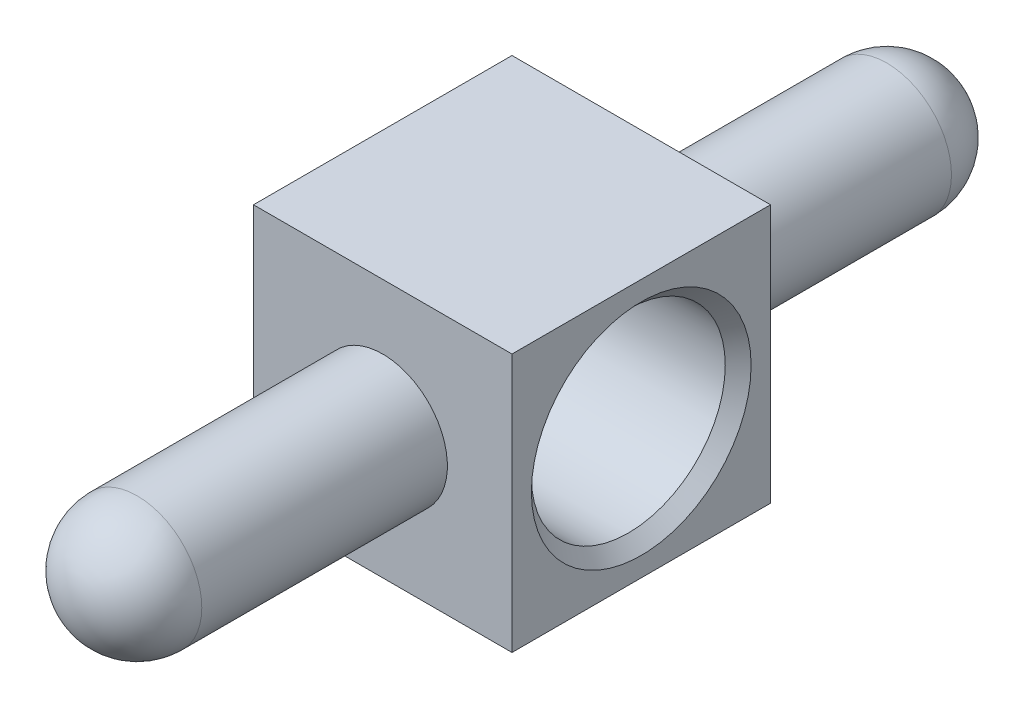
ISO-10303-21;
HEADER;
FILE_DESCRIPTION(('STEP AP214'),'2;1');
FILE_NAME('part.step','',(''),(''),'','','');
FILE_SCHEMA(('AUTOMOTIVE_DESIGN { 1 0 10303 214 1 1 1 1 }'));
ENDSEC;
DATA;
#1=APPLICATION_CONTEXT('core data for automotive mechanical design processes');
#2=APPLICATION_PROTOCOL_DEFINITION('international standard','automotive_design',2000,#1);
#3=PRODUCT_CONTEXT('',#1,'mechanical');
#4=PRODUCT('Part','Part','',(#3));
#5=PRODUCT_RELATED_PRODUCT_CATEGORY('part','',(#4));
#6=PRODUCT_DEFINITION_FORMATION('','',#4);
#7=PRODUCT_DEFINITION_CONTEXT('part definition',#1,'design');
#8=PRODUCT_DEFINITION('design','',#6,#7);
#9=PRODUCT_DEFINITION_SHAPE('','',#8);
#10=(LENGTH_UNIT() NAMED_UNIT(*) SI_UNIT(.MILLI.,.METRE.));
#11=(NAMED_UNIT(*) PLANE_ANGLE_UNIT() SI_UNIT($,.RADIAN.));
#12=(NAMED_UNIT(*) SI_UNIT($,.STERADIAN.) SOLID_ANGLE_UNIT());
#13=UNCERTAINTY_MEASURE_WITH_UNIT(LENGTH_MEASURE(1.E-05),#10,'distance_accuracy_value','');
#14=(GEOMETRIC_REPRESENTATION_CONTEXT(3) GLOBAL_UNCERTAINTY_ASSIGNED_CONTEXT((#13)) GLOBAL_UNIT_ASSIGNED_CONTEXT((#10,
#11,#12)) REPRESENTATION_CONTEXT('',''));
#15=CARTESIAN_POINT('',(0.,0.,0.));
#16=DIRECTION('',(0.,0.,1.));
#17=DIRECTION('',(1.,0.,0.));
#18=AXIS2_PLACEMENT_3D('',#15,#16,#17);
#19=CARTESIAN_POINT('',(0.,25.4,0.));
#20=DIRECTION('',(1.,0.,0.));
#21=DIRECTION('',(0.,0.,-1.));
#22=AXIS2_PLACEMENT_3D('',#19,#20,#21);
#23=PLANE('',#22);
#24=CARTESIAN_POINT('',(0.,12.7,12.7));
#25=DIRECTION('',(1.,0.,0.));
#26=DIRECTION('',(0.,0.,-1.));
#27=AXIS2_PLACEMENT_3D('',#24,#25,#26);
#28=CIRCLE('',#27,10.795);
#29=CARTESIAN_POINT('',(0.,12.7,1.905));
#30=VERTEX_POINT('',#29);
#31=EDGE_CURVE('E118',#30,#30,#28,.T.);
#32=ORIENTED_EDGE('',*,*,#31,.T.);
#33=EDGE_LOOP('',(#32));
#34=FACE_BOUND('',#33,.T.);
#35=DIRECTION('',(0.,0.,1.));
#36=VECTOR('',#35,1.);
#37=CARTESIAN_POINT('',(0.,0.,0.));
#38=LINE('',#37,#36);
#39=CARTESIAN_POINT('',(0.,0.,0.));
#40=VERTEX_POINT('',#39);
#41=CARTESIAN_POINT('',(0.,0.,25.4));
#42=VERTEX_POINT('',#41);
#43=EDGE_CURVE('E103',#40,#42,#38,.T.);
#44=ORIENTED_EDGE('',*,*,#43,.T.);
#45=DIRECTION('',(0.,-1.,0.));
#46=VECTOR('',#45,1.);
#47=CARTESIAN_POINT('',(0.,25.4,25.4));
#48=LINE('',#47,#46);
#49=CARTESIAN_POINT('',(0.,25.4,25.4));
#50=VERTEX_POINT('',#49);
#51=EDGE_CURVE('E94',#50,#42,#48,.T.);
#52=ORIENTED_EDGE('',*,*,#51,.F.);
#53=DIRECTION('',(0.,0.,1.));
#54=VECTOR('',#53,1.);
#55=CARTESIAN_POINT('',(0.,25.4,0.));
#56=LINE('',#55,#54);
#57=CARTESIAN_POINT('',(0.,25.4,0.));
#58=VERTEX_POINT('',#57);
#59=EDGE_CURVE('E88',#58,#50,#56,.T.);
#60=ORIENTED_EDGE('',*,*,#59,.F.);
#61=DIRECTION('',(0.,-1.,0.));
#62=VECTOR('',#61,1.);
#63=CARTESIAN_POINT('',(0.,25.4,0.));
#64=LINE('',#63,#62);
#65=EDGE_CURVE('E99',#58,#40,#64,.T.);
#66=ORIENTED_EDGE('',*,*,#65,.T.);
#67=EDGE_LOOP('',(#44,#52,#60,#66));
#68=FACE_BOUND('',#67,.T.);
#69=ADVANCED_FACE('F33',(#34,#68),#23,.F.);
#70=CARTESIAN_POINT('',(0.,25.4,25.4));
#71=DIRECTION('',(0.,0.,-1.));
#72=DIRECTION('',(-1.,0.,0.));
#73=AXIS2_PLACEMENT_3D('',#70,#71,#72);
#74=PLANE('',#73);
#75=CARTESIAN_POINT('',(12.7,12.7,25.4));
#76=DIRECTION('',(0.,0.,1.));
#77=DIRECTION('',(1.,0.,0.));
#78=AXIS2_PLACEMENT_3D('',#75,#76,#77);
#79=CIRCLE('',#78,6.35);
#80=CARTESIAN_POINT('',(6.35,12.7,25.4));
#81=VERTEX_POINT('',#80);
#82=EDGE_CURVE('E11',#81,#81,#79,.T.);
#83=ORIENTED_EDGE('',*,*,#82,.F.);
#84=EDGE_LOOP('',(#83));
#85=FACE_BOUND('',#84,.T.);
#86=DIRECTION('',(1.,0.,0.));
#87=VECTOR('',#86,1.);
#88=CARTESIAN_POINT('',(0.,0.,25.4));
#89=LINE('',#88,#87);
#90=CARTESIAN_POINT('',(25.4,0.,25.4));
#91=VERTEX_POINT('',#90);
#92=EDGE_CURVE('E93',#42,#91,#89,.T.);
#93=ORIENTED_EDGE('',*,*,#92,.T.);
#94=DIRECTION('',(0.,-1.,0.));
#95=VECTOR('',#94,1.);
#96=CARTESIAN_POINT('',(25.4,25.4,25.4));
#97=LINE('',#96,#95);
#98=CARTESIAN_POINT('',(25.4,25.4,25.4));
#99=VERTEX_POINT('',#98);
#100=EDGE_CURVE('E91',#99,#91,#97,.T.);
#101=ORIENTED_EDGE('',*,*,#100,.F.);
#102=DIRECTION('',(1.,0.,0.));
#103=VECTOR('',#102,1.);
#104=CARTESIAN_POINT('',(0.,25.4,25.4));
#105=LINE('',#104,#103);
#106=EDGE_CURVE('E83',#50,#99,#105,.T.);
#107=ORIENTED_EDGE('',*,*,#106,.F.);
#108=ORIENTED_EDGE('',*,*,#51,.T.);
#109=EDGE_LOOP('',(#93,#101,#107,#108));
#110=FACE_BOUND('',#109,.T.);
#111=ADVANCED_FACE('F92',(#85,#110),#74,.F.);
#112=CARTESIAN_POINT('',(25.4,25.4,0.));
#113=DIRECTION('',(-1.,0.,0.));
#114=DIRECTION('',(0.,0.,1.));
#115=AXIS2_PLACEMENT_3D('',#112,#113,#114);
#116=PLANE('',#115);
#117=CARTESIAN_POINT('',(25.4,12.7,12.7));
#118=DIRECTION('',(-1.,0.,0.));
#119=DIRECTION('',(0.,0.,1.));
#120=AXIS2_PLACEMENT_3D('',#117,#118,#119);
#121=CIRCLE('',#120,10.795);
#122=CARTESIAN_POINT('',(25.4,12.7,23.495));
#123=VERTEX_POINT('',#122);
#124=EDGE_CURVE('E116',#123,#123,#121,.T.);
#125=ORIENTED_EDGE('',*,*,#124,.T.);
#126=EDGE_LOOP('',(#125));
#127=FACE_BOUND('',#126,.T.);
#128=DIRECTION('',(0.,0.,-1.));
#129=VECTOR('',#128,1.);
#130=CARTESIAN_POINT('',(25.4,0.,0.));
#131=LINE('',#130,#129);
#132=CARTESIAN_POINT('',(25.4,0.,0.));
#133=VERTEX_POINT('',#132);
#134=EDGE_CURVE('E69',#91,#133,#131,.T.);
#135=ORIENTED_EDGE('',*,*,#134,.T.);
#136=DIRECTION('',(0.,-1.,0.));
#137=VECTOR('',#136,1.);
#138=CARTESIAN_POINT('',(25.4,25.4,0.));
#139=LINE('',#138,#137);
#140=CARTESIAN_POINT('',(25.4,25.4,0.));
#141=VERTEX_POINT('',#140);
#142=EDGE_CURVE('E95',#141,#133,#139,.T.);
#143=ORIENTED_EDGE('',*,*,#142,.F.);
#144=DIRECTION('',(0.,0.,-1.));
#145=VECTOR('',#144,1.);
#146=CARTESIAN_POINT('',(25.4,25.4,0.));
#147=LINE('',#146,#145);
#148=EDGE_CURVE('E86',#99,#141,#147,.T.);
#149=ORIENTED_EDGE('',*,*,#148,.F.);
#150=ORIENTED_EDGE('',*,*,#100,.T.);
#151=EDGE_LOOP('',(#135,#143,#149,#150));
#152=FACE_BOUND('',#151,.T.);
#153=ADVANCED_FACE('F97',(#127,#152),#116,.F.);
#154=CARTESIAN_POINT('',(0.,25.4,0.));
#155=DIRECTION('',(0.,0.,1.));
#156=DIRECTION('',(1.,0.,0.));
#157=AXIS2_PLACEMENT_3D('',#154,#155,#156);
#158=PLANE('',#157);
#159=CARTESIAN_POINT('',(12.7,12.7,0.));
#160=DIRECTION('',(0.,0.,-1.));
#161=DIRECTION('',(-1.,0.,0.));
#162=AXIS2_PLACEMENT_3D('',#159,#160,#161);
#163=CIRCLE('',#162,6.35);
#164=CARTESIAN_POINT('',(19.05,12.7,0.));
#165=VERTEX_POINT('',#164);
#166=EDGE_CURVE('E43',#165,#165,#163,.T.);
#167=ORIENTED_EDGE('',*,*,#166,.F.);
#168=EDGE_LOOP('',(#167));
#169=FACE_BOUND('',#168,.T.);
#170=DIRECTION('',(-1.,0.,0.));
#171=VECTOR('',#170,1.);
#172=CARTESIAN_POINT('',(0.,0.,0.));
#173=LINE('',#172,#171);
#174=EDGE_CURVE('E75',#133,#40,#173,.T.);
#175=ORIENTED_EDGE('',*,*,#174,.T.);
#176=ORIENTED_EDGE('',*,*,#65,.F.);
#177=DIRECTION('',(-1.,0.,0.));
#178=VECTOR('',#177,1.);
#179=CARTESIAN_POINT('',(0.,25.4,0.));
#180=LINE('',#179,#178);
#181=EDGE_CURVE('E52',#141,#58,#180,.T.);
#182=ORIENTED_EDGE('',*,*,#181,.F.);
#183=ORIENTED_EDGE('',*,*,#142,.T.);
#184=EDGE_LOOP('',(#175,#176,#182,#183));
#185=FACE_BOUND('',#184,.T.);
#186=ADVANCED_FACE('F152',(#169,#185),#158,.F.);
#187=CARTESIAN_POINT('',(0.,25.4,0.));
#188=DIRECTION('',(0.,1.,0.));
#189=DIRECTION('',(0.,0.,1.));
#190=AXIS2_PLACEMENT_3D('',#187,#188,#189);
#191=PLANE('',#190);
#192=ORIENTED_EDGE('',*,*,#59,.T.);
#193=ORIENTED_EDGE('',*,*,#106,.T.);
#194=ORIENTED_EDGE('',*,*,#148,.T.);
#195=ORIENTED_EDGE('',*,*,#181,.T.);
#196=EDGE_LOOP('',(#192,#193,#194,#195));
#197=FACE_BOUND('',#196,.T.);
#198=ADVANCED_FACE('F84',(#197),#191,.T.);
#199=CARTESIAN_POINT('',(0.,0.,0.));
#200=DIRECTION('',(0.,1.,0.));
#201=DIRECTION('',(0.,0.,1.));
#202=AXIS2_PLACEMENT_3D('',#199,#200,#201);
#203=PLANE('',#202);
#204=ORIENTED_EDGE('',*,*,#43,.F.);
#205=ORIENTED_EDGE('',*,*,#174,.F.);
#206=ORIENTED_EDGE('',*,*,#134,.F.);
#207=ORIENTED_EDGE('',*,*,#92,.F.);
#208=EDGE_LOOP('',(#204,#205,#206,#207));
#209=FACE_BOUND('',#208,.T.);
#210=ADVANCED_FACE('F166',(#209),#203,.F.);
#211=CARTESIAN_POINT('',(0.,12.7,12.7));
#212=DIRECTION('',(1.,0.,0.));
#213=DIRECTION('',(0.,0.,-1.));
#214=AXIS2_PLACEMENT_3D('',#211,#212,#213);
#215=CYLINDRICAL_SURFACE('',#214,9.525);
#216=CARTESIAN_POINT('',(1.27,12.7,12.7));
#217=DIRECTION('',(1.,0.,0.));
#218=DIRECTION('',(0.,0.,-1.));
#219=AXIS2_PLACEMENT_3D('',#216,#217,#218);
#220=CIRCLE('',#219,9.525);
#221=CARTESIAN_POINT('',(1.27,12.7,3.17500000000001));
#222=VERTEX_POINT('',#221);
#223=EDGE_CURVE('E37',#222,#222,#220,.F.);
#224=ORIENTED_EDGE('',*,*,#223,.T.);
#225=EDGE_LOOP('',(#224));
#226=FACE_BOUND('',#225,.T.);
#227=CARTESIAN_POINT('',(24.13,12.7,12.7));
#228=DIRECTION('',(-1.,0.,0.));
#229=DIRECTION('',(0.,0.,1.));
#230=AXIS2_PLACEMENT_3D('',#227,#228,#229);
#231=CIRCLE('',#230,9.525);
#232=CARTESIAN_POINT('',(24.13,12.7,22.225));
#233=VERTEX_POINT('',#232);
#234=EDGE_CURVE('E113',#233,#233,#231,.F.);
#235=ORIENTED_EDGE('',*,*,#234,.T.);
#236=EDGE_LOOP('',(#235));
#237=FACE_BOUND('',#236,.T.);
#238=ADVANCED_FACE('F159',(#226,#237),#215,.F.);
#239=CARTESIAN_POINT('',(24.13,12.7,12.7));
#240=DIRECTION('',(1.,0.,0.));
#241=DIRECTION('',(0.,0.,-1.));
#242=AXIS2_PLACEMENT_3D('',#239,#240,#241);
#243=CONICAL_SURFACE('',#242,9.525,0.785398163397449);
#244=ORIENTED_EDGE('',*,*,#124,.F.);
#245=EDGE_LOOP('',(#244));
#246=FACE_BOUND('',#245,.T.);
#247=ORIENTED_EDGE('',*,*,#234,.F.);
#248=EDGE_LOOP('',(#247));
#249=FACE_BOUND('',#248,.T.);
#250=ADVANCED_FACE('F157',(#246,#249),#243,.F.);
#251=CARTESIAN_POINT('',(0.,12.7,12.7));
#252=DIRECTION('',(-1.,0.,0.));
#253=DIRECTION('',(0.,0.,1.));
#254=AXIS2_PLACEMENT_3D('',#251,#252,#253);
#255=CONICAL_SURFACE('',#254,10.795,0.785398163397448);
#256=ORIENTED_EDGE('',*,*,#223,.F.);
#257=EDGE_LOOP('',(#256));
#258=FACE_BOUND('',#257,.T.);
#259=ORIENTED_EDGE('',*,*,#31,.F.);
#260=EDGE_LOOP('',(#259));
#261=FACE_BOUND('',#260,.T.);
#262=ADVANCED_FACE('F35',(#258,#261),#255,.F.);
#263=CARTESIAN_POINT('',(12.7,12.7,-24.13));
#264=DIRECTION('',(0.,0.,1.));
#265=DIRECTION('',(1.,0.,0.));
#266=AXIS2_PLACEMENT_3D('',#263,#264,#265);
#267=CYLINDRICAL_SURFACE('',#266,6.35);
#268=CARTESIAN_POINT('',(12.7,12.7,-24.13));
#269=DIRECTION('',(0.,0.,-1.));
#270=DIRECTION('',(-1.,0.,0.));
#271=AXIS2_PLACEMENT_3D('',#268,#269,#270);
#272=CIRCLE('',#271,6.35);
#273=CARTESIAN_POINT('',(19.05,12.7,-24.13));
#274=VERTEX_POINT('',#273);
#275=EDGE_CURVE('E106',#274,#274,#272,.T.);
#276=CARTESIAN_POINT('',(19.05,12.7,-24.13));
#277=CARTESIAN_POINT('',(19.05,12.7,-23.8786458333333));
#278=CARTESIAN_POINT('',(19.05,12.7,-23.6272916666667));
#279=CARTESIAN_POINT('',(19.05,12.7,-23.1245833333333));
#280=CARTESIAN_POINT('',(19.05,12.7,-22.8732291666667));
#281=CARTESIAN_POINT('',(19.05,12.7,-22.3705208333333));
#282=CARTESIAN_POINT('',(19.05,12.7,-22.1191666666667));
#283=CARTESIAN_POINT('',(19.05,12.7,-21.6164583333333));
#284=CARTESIAN_POINT('',(19.05,12.7,-21.3651041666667));
#285=CARTESIAN_POINT('',(19.05,12.7,-20.8623958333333));
#286=CARTESIAN_POINT('',(19.05,12.7,-20.6110416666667));
#287=CARTESIAN_POINT('',(19.05,12.7,-20.1083333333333));
#288=CARTESIAN_POINT('',(19.05,12.7,-19.8569791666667));
#289=CARTESIAN_POINT('',(19.05,12.7,-19.3542708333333));
#290=CARTESIAN_POINT('',(19.05,12.7,-19.1029166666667));
#291=CARTESIAN_POINT('',(19.05,12.7,-18.6002083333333));
#292=CARTESIAN_POINT('',(19.05,12.7,-18.3488541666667));
#293=CARTESIAN_POINT('',(19.05,12.7,-17.8461458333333));
#294=CARTESIAN_POINT('',(19.05,12.7,-17.5947916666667));
#295=CARTESIAN_POINT('',(19.05,12.7,-17.0920833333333));
#296=CARTESIAN_POINT('',(19.05,12.7,-16.8407291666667));
#297=CARTESIAN_POINT('',(19.05,12.7,-16.3380208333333));
#298=CARTESIAN_POINT('',(19.05,12.7,-16.0866666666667));
#299=CARTESIAN_POINT('',(19.05,12.7,-15.5839583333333));
#300=CARTESIAN_POINT('',(19.05,12.7,-15.3326041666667));
#301=CARTESIAN_POINT('',(19.05,12.7,-14.8298958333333));
#302=CARTESIAN_POINT('',(19.05,12.7,-14.5785416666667));
#303=CARTESIAN_POINT('',(19.05,12.7,-14.0758333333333));
#304=CARTESIAN_POINT('',(19.05,12.7,-13.8244791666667));
#305=CARTESIAN_POINT('',(19.05,12.7,-13.3217708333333));
#306=CARTESIAN_POINT('',(19.05,12.7,-13.0704166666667));
#307=CARTESIAN_POINT('',(19.05,12.7,-12.5677083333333));
#308=CARTESIAN_POINT('',(19.05,12.7,-12.3163541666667));
#309=CARTESIAN_POINT('',(19.05,12.7,-11.8136458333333));
#310=CARTESIAN_POINT('',(19.05,12.7,-11.5622916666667));
#311=CARTESIAN_POINT('',(19.05,12.7,-11.0595833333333));
#312=CARTESIAN_POINT('',(19.05,12.7,-10.8082291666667));
#313=CARTESIAN_POINT('',(19.05,12.7,-10.3055208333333));
#314=CARTESIAN_POINT('',(19.05,12.7,-10.0541666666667));
#315=CARTESIAN_POINT('',(19.05,12.7,-9.55145833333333));
#316=CARTESIAN_POINT('',(19.05,12.7,-9.30010416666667));
#317=CARTESIAN_POINT('',(19.05,12.7,-8.79739583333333));
#318=CARTESIAN_POINT('',(19.05,12.7,-8.54604166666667));
#319=CARTESIAN_POINT('',(19.05,12.7,-8.04333333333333));
#320=CARTESIAN_POINT('',(19.05,12.7,-7.79197916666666));
#321=CARTESIAN_POINT('',(19.05,12.7,-7.28927083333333));
#322=CARTESIAN_POINT('',(19.05,12.7,-7.03791666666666));
#323=CARTESIAN_POINT('',(19.05,12.7,-6.53520833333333));
#324=CARTESIAN_POINT('',(19.05,12.7,-6.28385416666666));
#325=CARTESIAN_POINT('',(19.05,12.7,-5.78114583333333));
#326=CARTESIAN_POINT('',(19.05,12.7,-5.52979166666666));
#327=CARTESIAN_POINT('',(19.05,12.7,-5.02708333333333));
#328=CARTESIAN_POINT('',(19.05,12.7,-4.77572916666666));
#329=CARTESIAN_POINT('',(19.05,12.7,-4.27302083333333));
#330=CARTESIAN_POINT('',(19.05,12.7,-4.02166666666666));
#331=CARTESIAN_POINT('',(19.05,12.7,-3.51895833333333));
#332=CARTESIAN_POINT('',(19.05,12.7,-3.26760416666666));
#333=CARTESIAN_POINT('',(19.05,12.7,-2.76489583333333));
#334=CARTESIAN_POINT('',(19.05,12.7,-2.51354166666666));
#335=CARTESIAN_POINT('',(19.05,12.7,-2.01083333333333));
#336=CARTESIAN_POINT('',(19.05,12.7,-1.75947916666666));
#337=CARTESIAN_POINT('',(19.05,12.7,-1.25677083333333));
#338=CARTESIAN_POINT('',(19.05,12.7,-1.00541666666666));
#339=CARTESIAN_POINT('',(19.05,12.7,-0.50270833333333));
#340=CARTESIAN_POINT('',(19.05,12.7,-0.251354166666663));
#341=CARTESIAN_POINT('',(19.05,12.7,0.));
#342=B_SPLINE_CURVE_WITH_KNOTS('',3,(#276,#277,#278,#279,#280,#281,#282,#283,#284,#285,#286,
#287,#288,#289,#290,#291,#292,#293,#294,#295,#296,#297,#298,#299,#300,#301,#302,#303,#304,#305,
#306,#307,#308,#309,#310,#311,#312,#313,#314,#315,#316,#317,#318,#319,#320,#321,#322,#323,#324,
#325,#326,#327,#328,#329,#330,#331,#332,#333,#334,#335,#336,#337,#338,#339,#340,#341),
.UNSPECIFIED.,.F.,.F.,(4,2,2,2,2,2,2,2,2,2,2,2,2,2,2,2,2,2,2,2,2,2,2,2,2,2,2,2,2,2,2,2,4),(0.,
0.7540625,1.508125,2.2621875,3.01625,3.7703125,4.524375,5.2784375,6.0325,6.7865625,7.540625,
8.2946875,9.04875,9.8028125,10.556875,11.3109375,12.065,12.8190625,13.573125,14.3271875,
15.08125,15.8353125,16.589375,17.3434375,18.0975,18.8515625,19.605625,20.3596875,21.11375,
21.8678125,22.621875,23.3759375,24.13),.UNSPECIFIED.);
#343=EDGE_CURVE('BSEAM142',#274,#165,#342,.T.);
#344=ORIENTED_EDGE('',*,*,#275,.F.);
#345=ORIENTED_EDGE('',*,*,#166,.T.);
#346=ORIENTED_EDGE('',*,*,#343,.T.);
#347=ORIENTED_EDGE('',*,*,#343,.F.);
#348=EDGE_LOOP('',(#344,#346,#345,#347));
#349=FACE_BOUND('',#348,.T.);
#350=ADVANCED_FACE('F142',(#349),#267,.T.);
#351=CARTESIAN_POINT('',(12.7,12.7,49.53));
#352=DIRECTION('',(0.,0.,-1.));
#353=DIRECTION('',(-1.,0.,0.));
#354=AXIS2_PLACEMENT_3D('',#351,#352,#353);
#355=CYLINDRICAL_SURFACE('',#354,6.35);
#356=CARTESIAN_POINT('',(12.7,12.7,49.53));
#357=DIRECTION('',(0.,0.,1.));
#358=DIRECTION('',(1.,0.,0.));
#359=AXIS2_PLACEMENT_3D('',#356,#357,#358);
#360=CIRCLE('',#359,6.35);
#361=CARTESIAN_POINT('',(6.35,12.7,49.53));
#362=VERTEX_POINT('',#361);
#363=EDGE_CURVE('E131',#362,#362,#360,.T.);
#364=CARTESIAN_POINT('',(6.35,12.7,49.53));
#365=CARTESIAN_POINT('',(6.35,12.7,49.2786458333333));
#366=CARTESIAN_POINT('',(6.35,12.7,49.0272916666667));
#367=CARTESIAN_POINT('',(6.35,12.7,48.5245833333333));
#368=CARTESIAN_POINT('',(6.35,12.7,48.2732291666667));
#369=CARTESIAN_POINT('',(6.35,12.7,47.7705208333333));
#370=CARTESIAN_POINT('',(6.35,12.7,47.5191666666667));
#371=CARTESIAN_POINT('',(6.35,12.7,47.0164583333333));
#372=CARTESIAN_POINT('',(6.35,12.7,46.7651041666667));
#373=CARTESIAN_POINT('',(6.35,12.7,46.2623958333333));
#374=CARTESIAN_POINT('',(6.35,12.7,46.0110416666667));
#375=CARTESIAN_POINT('',(6.35,12.7,45.5083333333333));
#376=CARTESIAN_POINT('',(6.35,12.7,45.2569791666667));
#377=CARTESIAN_POINT('',(6.35,12.7,44.7542708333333));
#378=CARTESIAN_POINT('',(6.35,12.7,44.5029166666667));
#379=CARTESIAN_POINT('',(6.35,12.7,44.0002083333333));
#380=CARTESIAN_POINT('',(6.35,12.7,43.7488541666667));
#381=CARTESIAN_POINT('',(6.35,12.7,43.2461458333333));
#382=CARTESIAN_POINT('',(6.35,12.7,42.9947916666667));
#383=CARTESIAN_POINT('',(6.35,12.7,42.4920833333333));
#384=CARTESIAN_POINT('',(6.35,12.7,42.2407291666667));
#385=CARTESIAN_POINT('',(6.35,12.7,41.7380208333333));
#386=CARTESIAN_POINT('',(6.35,12.7,41.4866666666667));
#387=CARTESIAN_POINT('',(6.35,12.7,40.9839583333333));
#388=CARTESIAN_POINT('',(6.35,12.7,40.7326041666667));
#389=CARTESIAN_POINT('',(6.35,12.7,40.2298958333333));
#390=CARTESIAN_POINT('',(6.35,12.7,39.9785416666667));
#391=CARTESIAN_POINT('',(6.35,12.7,39.4758333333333));
#392=CARTESIAN_POINT('',(6.35,12.7,39.2244791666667));
#393=CARTESIAN_POINT('',(6.35,12.7,38.7217708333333));
#394=CARTESIAN_POINT('',(6.35,12.7,38.4704166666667));
#395=CARTESIAN_POINT('',(6.35,12.7,37.9677083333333));
#396=CARTESIAN_POINT('',(6.35,12.7,37.7163541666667));
#397=CARTESIAN_POINT('',(6.35,12.7,37.2136458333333));
#398=CARTESIAN_POINT('',(6.35,12.7,36.9622916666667));
#399=CARTESIAN_POINT('',(6.35,12.7,36.4595833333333));
#400=CARTESIAN_POINT('',(6.35,12.7,36.2082291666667));
#401=CARTESIAN_POINT('',(6.35,12.7,35.7055208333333));
#402=CARTESIAN_POINT('',(6.35,12.7,35.4541666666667));
#403=CARTESIAN_POINT('',(6.35,12.7,34.9514583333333));
#404=CARTESIAN_POINT('',(6.35,12.7,34.7001041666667));
#405=CARTESIAN_POINT('',(6.35,12.7,34.1973958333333));
#406=CARTESIAN_POINT('',(6.35,12.7,33.9460416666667));
#407=CARTESIAN_POINT('',(6.35,12.7,33.4433333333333));
#408=CARTESIAN_POINT('',(6.35,12.7,33.1919791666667));
#409=CARTESIAN_POINT('',(6.35,12.7,32.6892708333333));
#410=CARTESIAN_POINT('',(6.35,12.7,32.4379166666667));
#411=CARTESIAN_POINT('',(6.35,12.7,31.9352083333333));
#412=CARTESIAN_POINT('',(6.35,12.7,31.6838541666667));
#413=CARTESIAN_POINT('',(6.35,12.7,31.1811458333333));
#414=CARTESIAN_POINT('',(6.35,12.7,30.9297916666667));
#415=CARTESIAN_POINT('',(6.35,12.7,30.4270833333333));
#416=CARTESIAN_POINT('',(6.35,12.7,30.1757291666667));
#417=CARTESIAN_POINT('',(6.35,12.7,29.6730208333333));
#418=CARTESIAN_POINT('',(6.35,12.7,29.4216666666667));
#419=CARTESIAN_POINT('',(6.35,12.7,28.9189583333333));
#420=CARTESIAN_POINT('',(6.35,12.7,28.6676041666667));
#421=CARTESIAN_POINT('',(6.35,12.7,28.1648958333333));
#422=CARTESIAN_POINT('',(6.35,12.7,27.9135416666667));
#423=CARTESIAN_POINT('',(6.35,12.7,27.4108333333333));
#424=CARTESIAN_POINT('',(6.35,12.7,27.1594791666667));
#425=CARTESIAN_POINT('',(6.35,12.7,26.6567708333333));
#426=CARTESIAN_POINT('',(6.35,12.7,26.4054166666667));
#427=CARTESIAN_POINT('',(6.35,12.7,25.9027083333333));
#428=CARTESIAN_POINT('',(6.35,12.7,25.6513541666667));
#429=CARTESIAN_POINT('',(6.35,12.7,25.4));
#430=B_SPLINE_CURVE_WITH_KNOTS('',3,(#364,#365,#366,#367,#368,#369,#370,#371,#372,#373,#374,
#375,#376,#377,#378,#379,#380,#381,#382,#383,#384,#385,#386,#387,#388,#389,#390,#391,#392,#393,
#394,#395,#396,#397,#398,#399,#400,#401,#402,#403,#404,#405,#406,#407,#408,#409,#410,#411,#412,
#413,#414,#415,#416,#417,#418,#419,#420,#421,#422,#423,#424,#425,#426,#427,#428,#429),
.UNSPECIFIED.,.F.,.F.,(4,2,2,2,2,2,2,2,2,2,2,2,2,2,2,2,2,2,2,2,2,2,2,2,2,2,2,2,2,2,2,2,4),(0.,
0.754062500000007,1.50812500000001,2.26218750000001,3.01625000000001,3.7703125,4.524375,
5.2784375,6.0325,6.7865625,7.540625,8.2946875,9.04875,9.8028125,10.556875,11.3109375,12.065,
12.8190625,13.573125,14.3271875,15.08125,15.8353125,16.589375,17.3434375,18.0975,18.8515625,
19.605625,20.3596875,21.11375,21.8678125,22.621875,23.3759375,24.13),.UNSPECIFIED.);
#431=EDGE_CURVE('BSEAM138',#362,#81,#430,.T.);
#432=ORIENTED_EDGE('',*,*,#363,.F.);
#433=ORIENTED_EDGE('',*,*,#82,.T.);
#434=ORIENTED_EDGE('',*,*,#431,.T.);
#435=ORIENTED_EDGE('',*,*,#431,.F.);
#436=EDGE_LOOP('',(#432,#434,#433,#435));
#437=FACE_BOUND('',#436,.T.);
#438=ADVANCED_FACE('F138',(#437),#355,.T.);
#439=CARTESIAN_POINT('',(12.7,12.7,-24.13));
#440=DIRECTION('',(-1.,0.,0.));
#441=DIRECTION('',(0.,-1.,0.));
#442=AXIS2_PLACEMENT_3D('',#439,#440,#441);
#443=SPHERICAL_SURFACE('',#442,6.35);
#444=CARTESIAN_POINT('',(12.7,12.7,-24.13));
#445=DIRECTION('',(0.,0.,-1.));
#446=DIRECTION('',(-1.,0.,0.));
#447=AXIS2_PLACEMENT_3D('',#444,#445,#446);
#448=SPHERICAL_SURFACE('',#447,6.35);
#449=ORIENTED_EDGE('',*,*,#275,.T.);
#450=EDGE_LOOP('',(#449));
#451=FACE_BOUND('',#450,.T.);
#452=ADVANCED_FACE('F141',(#451),#448,.T.);
#453=CARTESIAN_POINT('',(12.7,12.7,49.53));
#454=DIRECTION('',(0.,-1.,0.));
#455=DIRECTION('',(-1.,0.,0.));
#456=AXIS2_PLACEMENT_3D('',#453,#454,#455);
#457=SPHERICAL_SURFACE('',#456,6.35);
#458=CARTESIAN_POINT('',(12.7,12.7,49.53));
#459=DIRECTION('',(0.,0.,1.));
#460=DIRECTION('',(1.,0.,0.));
#461=AXIS2_PLACEMENT_3D('',#458,#459,#460);
#462=SPHERICAL_SURFACE('',#461,6.35);
#463=ORIENTED_EDGE('',*,*,#363,.T.);
#464=EDGE_LOOP('',(#463));
#465=FACE_BOUND('',#464,.T.);
#466=ADVANCED_FACE('F136',(#465),#462,.T.);
#467=CLOSED_SHELL('',(#69,#111,#153,#186,#198,#210,#238,#250,#262,#350,#438,#452,#466));
#468=MANIFOLD_SOLID_BREP('B2',#467);
#469=ADVANCED_BREP_SHAPE_REPRESENTATION('',(#18,#468),#14);
#470=SHAPE_DEFINITION_REPRESENTATION(#9,#469);
ENDSEC;
END-ISO-10303-21;
